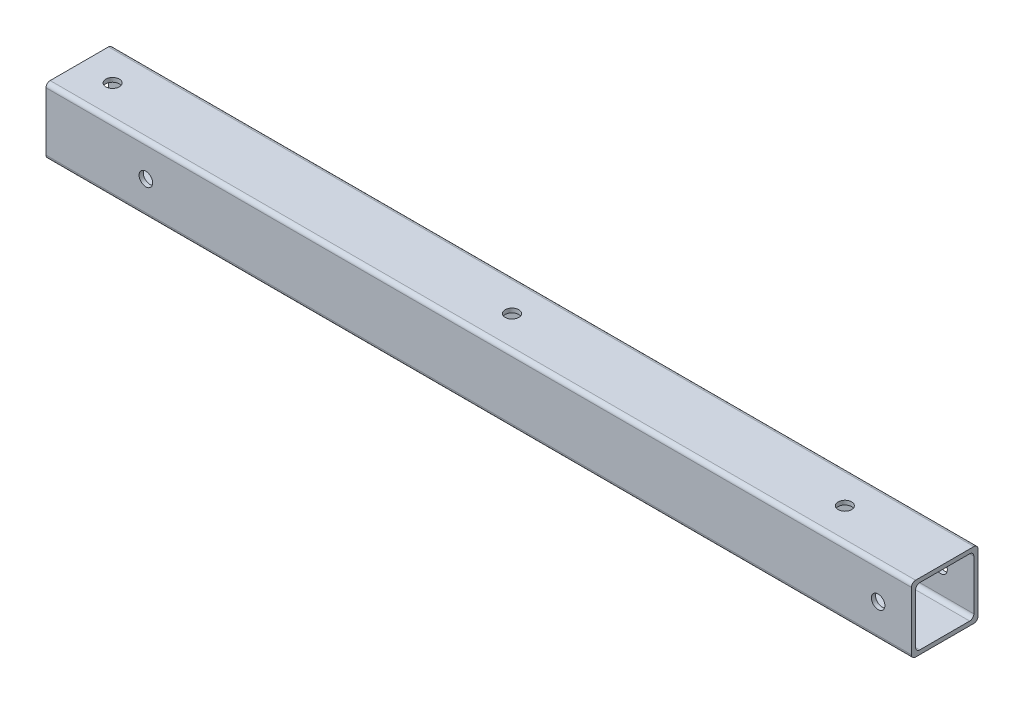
ISO-10303-21;
HEADER;
FILE_DESCRIPTION(('STEP AP214'),'2;1');
FILE_NAME('part.step','',(''),(''),'','','');
FILE_SCHEMA(('AUTOMOTIVE_DESIGN { 1 0 10303 214 1 1 1 1 }'));
ENDSEC;
DATA;
#1=APPLICATION_CONTEXT('core data for automotive mechanical design processes');
#2=APPLICATION_PROTOCOL_DEFINITION('international standard','automotive_design',2000,#1);
#3=PRODUCT_CONTEXT('',#1,'mechanical');
#4=PRODUCT('Part','Part','',(#3));
#5=PRODUCT_RELATED_PRODUCT_CATEGORY('part','',(#4));
#6=PRODUCT_DEFINITION_FORMATION('','',#4);
#7=PRODUCT_DEFINITION_CONTEXT('part definition',#1,'design');
#8=PRODUCT_DEFINITION('design','',#6,#7);
#9=PRODUCT_DEFINITION_SHAPE('','',#8);
#10=(LENGTH_UNIT() NAMED_UNIT(*) SI_UNIT(.MILLI.,.METRE.));
#11=(NAMED_UNIT(*) PLANE_ANGLE_UNIT() SI_UNIT($,.RADIAN.));
#12=(NAMED_UNIT(*) SI_UNIT($,.STERADIAN.) SOLID_ANGLE_UNIT());
#13=UNCERTAINTY_MEASURE_WITH_UNIT(LENGTH_MEASURE(1.E-05),#10,'distance_accuracy_value','');
#14=(GEOMETRIC_REPRESENTATION_CONTEXT(3) GLOBAL_UNCERTAINTY_ASSIGNED_CONTEXT((#13)) GLOBAL_UNIT_ASSIGNED_CONTEXT((#10,
#11,#12)) REPRESENTATION_CONTEXT('',''));
#15=CARTESIAN_POINT('',(0.,0.,0.));
#16=DIRECTION('',(0.,0.,1.));
#17=DIRECTION('',(1.,0.,0.));
#18=AXIS2_PLACEMENT_3D('',#15,#16,#17);
#19=CARTESIAN_POINT('',(0.,101.6,0.));
#20=DIRECTION('',(-1.,0.,0.));
#21=DIRECTION('',(0.,0.,1.));
#22=AXIS2_PLACEMENT_3D('',#19,#20,#21);
#23=PLANE('',#22);
#24=DIRECTION('',(0.,0.,1.));
#25=VECTOR('',#24,1.);
#26=CARTESIAN_POINT('',(0.,95.25,6.35000000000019));
#27=LINE('',#26,#25);
#28=CARTESIAN_POINT('',(0.,95.25,12.7000000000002));
#29=VERTEX_POINT('',#28);
#30=CARTESIAN_POINT('',(0.,95.25,88.9000000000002));
#31=VERTEX_POINT('',#30);
#32=EDGE_CURVE('E169',#29,#31,#27,.T.);
#33=ORIENTED_EDGE('',*,*,#32,.F.);
#34=CARTESIAN_POINT('',(0.,88.9,12.7000000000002));
#35=DIRECTION('',(-1.,0.,0.));
#36=DIRECTION('',(0.,0.,1.));
#37=AXIS2_PLACEMENT_3D('',#34,#35,#36);
#38=CIRCLE('',#37,6.35);
#39=CARTESIAN_POINT('',(0.,88.9,6.35000000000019));
#40=VERTEX_POINT('',#39);
#41=EDGE_CURVE('E179',#29,#40,#38,.T.);
#42=ORIENTED_EDGE('',*,*,#41,.T.);
#43=DIRECTION('',(0.,1.,0.));
#44=VECTOR('',#43,1.);
#45=CARTESIAN_POINT('',(0.,95.25,6.35000000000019));
#46=LINE('',#45,#44);
#47=CARTESIAN_POINT('',(0.,12.7,6.3500000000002));
#48=VERTEX_POINT('',#47);
#49=EDGE_CURVE('E240',#48,#40,#46,.T.);
#50=ORIENTED_EDGE('',*,*,#49,.F.);
#51=CARTESIAN_POINT('',(0.,12.7,12.7000000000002));
#52=DIRECTION('',(-1.,0.,0.));
#53=DIRECTION('',(0.,0.,1.));
#54=AXIS2_PLACEMENT_3D('',#51,#52,#53);
#55=CIRCLE('',#54,6.35);
#56=CARTESIAN_POINT('',(0.,6.35,12.7000000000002));
#57=VERTEX_POINT('',#56);
#58=EDGE_CURVE('E11',#48,#57,#55,.T.);
#59=ORIENTED_EDGE('',*,*,#58,.T.);
#60=DIRECTION('',(0.,0.,-1.));
#61=VECTOR('',#60,1.);
#62=CARTESIAN_POINT('',(0.,6.35,6.35000000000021));
#63=LINE('',#62,#61);
#64=CARTESIAN_POINT('',(0.,6.35,88.9000000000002));
#65=VERTEX_POINT('',#64);
#66=EDGE_CURVE('E253',#65,#57,#63,.T.);
#67=ORIENTED_EDGE('',*,*,#66,.F.);
#68=CARTESIAN_POINT('',(0.,12.7,88.9000000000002));
#69=DIRECTION('',(-1.,0.,0.));
#70=DIRECTION('',(0.,0.,1.));
#71=AXIS2_PLACEMENT_3D('',#68,#69,#70);
#72=CIRCLE('',#71,6.35);
#73=CARTESIAN_POINT('',(0.,12.7,95.2500000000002));
#74=VERTEX_POINT('',#73);
#75=EDGE_CURVE('E168',#65,#74,#72,.T.);
#76=ORIENTED_EDGE('',*,*,#75,.T.);
#77=DIRECTION('',(0.,-1.,0.));
#78=VECTOR('',#77,1.);
#79=CARTESIAN_POINT('',(0.,95.25,95.2500000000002));
#80=LINE('',#79,#78);
#81=CARTESIAN_POINT('',(0.,88.9,95.2500000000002));
#82=VERTEX_POINT('',#81);
#83=EDGE_CURVE('E152',#82,#74,#80,.T.);
#84=ORIENTED_EDGE('',*,*,#83,.F.);
#85=CARTESIAN_POINT('',(0.,88.9,88.9000000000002));
#86=DIRECTION('',(-1.,0.,0.));
#87=DIRECTION('',(0.,0.,1.));
#88=AXIS2_PLACEMENT_3D('',#85,#86,#87);
#89=CIRCLE('',#88,6.35);
#90=EDGE_CURVE('E164',#82,#31,#89,.T.);
#91=ORIENTED_EDGE('',*,*,#90,.T.);
#92=EDGE_LOOP('',(#33,#42,#50,#59,#67,#76,#84,#91));
#93=FACE_BOUND('',#92,.T.);
#94=DIRECTION('',(0.,-1.,0.));
#95=VECTOR('',#94,1.);
#96=CARTESIAN_POINT('',(0.,101.6,101.6));
#97=LINE('',#96,#95);
#98=CARTESIAN_POINT('',(0.,95.25,101.6));
#99=VERTEX_POINT('',#98);
#100=CARTESIAN_POINT('',(0.,6.34999999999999,101.6));
#101=VERTEX_POINT('',#100);
#102=EDGE_CURVE('E264',#99,#101,#97,.T.);
#103=ORIENTED_EDGE('',*,*,#102,.T.);
#104=CARTESIAN_POINT('',(0.,6.34999999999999,95.25));
#105=DIRECTION('',(-1.,0.,0.));
#106=DIRECTION('',(0.,0.,1.));
#107=AXIS2_PLACEMENT_3D('',#104,#105,#106);
#108=CIRCLE('',#107,6.35);
#109=CARTESIAN_POINT('',(0.,0.,95.25));
#110=VERTEX_POINT('',#109);
#111=EDGE_CURVE('E295',#101,#110,#108,.F.);
#112=ORIENTED_EDGE('',*,*,#111,.T.);
#113=DIRECTION('',(0.,0.,-1.));
#114=VECTOR('',#113,1.);
#115=CARTESIAN_POINT('',(0.,0.,0.));
#116=LINE('',#115,#114);
#117=CARTESIAN_POINT('',(0.,0.,6.35));
#118=VERTEX_POINT('',#117);
#119=EDGE_CURVE('E256',#110,#118,#116,.T.);
#120=ORIENTED_EDGE('',*,*,#119,.T.);
#121=CARTESIAN_POINT('',(0.,6.34999999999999,6.35));
#122=DIRECTION('',(-1.,0.,0.));
#123=DIRECTION('',(0.,0.,1.));
#124=AXIS2_PLACEMENT_3D('',#121,#122,#123);
#125=CIRCLE('',#124,6.35);
#126=CARTESIAN_POINT('',(0.,6.34999999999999,0.));
#127=VERTEX_POINT('',#126);
#128=EDGE_CURVE('E289',#118,#127,#125,.F.);
#129=ORIENTED_EDGE('',*,*,#128,.T.);
#130=DIRECTION('',(0.,-1.,0.));
#131=VECTOR('',#130,1.);
#132=CARTESIAN_POINT('',(0.,101.6,0.));
#133=LINE('',#132,#131);
#134=CARTESIAN_POINT('',(0.,95.25,0.));
#135=VERTEX_POINT('',#134);
#136=EDGE_CURVE('E159',#135,#127,#133,.T.);
#137=ORIENTED_EDGE('',*,*,#136,.F.);
#138=CARTESIAN_POINT('',(0.,95.25,6.35));
#139=DIRECTION('',(-1.,0.,0.));
#140=DIRECTION('',(0.,0.,1.));
#141=AXIS2_PLACEMENT_3D('',#138,#139,#140);
#142=CIRCLE('',#141,6.35);
#143=CARTESIAN_POINT('',(0.,101.6,6.35));
#144=VERTEX_POINT('',#143);
#145=EDGE_CURVE('E291',#135,#144,#142,.F.);
#146=ORIENTED_EDGE('',*,*,#145,.T.);
#147=DIRECTION('',(0.,0.,-1.));
#148=VECTOR('',#147,1.);
#149=CARTESIAN_POINT('',(0.,101.6,0.));
#150=LINE('',#149,#148);
#151=CARTESIAN_POINT('',(0.,101.6,95.25));
#152=VERTEX_POINT('',#151);
#153=EDGE_CURVE('E257',#152,#144,#150,.T.);
#154=ORIENTED_EDGE('',*,*,#153,.F.);
#155=CARTESIAN_POINT('',(0.,95.25,95.25));
#156=DIRECTION('',(-1.,0.,0.));
#157=DIRECTION('',(0.,0.,1.));
#158=AXIS2_PLACEMENT_3D('',#155,#156,#157);
#159=CIRCLE('',#158,6.35);
#160=EDGE_CURVE('E293',#152,#99,#159,.F.);
#161=ORIENTED_EDGE('',*,*,#160,.T.);
#162=EDGE_LOOP('',(#103,#112,#120,#129,#137,#146,#154,#161));
#163=FACE_BOUND('',#162,.T.);
#164=ADVANCED_FACE('F31',(#93,#163),#23,.F.);
#165=CARTESIAN_POINT('',(0.,101.6,0.));
#166=DIRECTION('',(0.,0.,1.));
#167=DIRECTION('',(1.,0.,0.));
#168=AXIS2_PLACEMENT_3D('',#165,#166,#167);
#169=PLANE('',#168);
#170=CARTESIAN_POINT('',(-50.8,50.8,0.));
#171=DIRECTION('',(0.,0.,1.));
#172=DIRECTION('',(1.,0.,0.));
#173=AXIS2_PLACEMENT_3D('',#170,#171,#172);
#174=CIRCLE('',#173,10.31875);
#175=CARTESIAN_POINT('',(-40.48125,50.8,0.));
#176=VERTEX_POINT('',#175);
#177=EDGE_CURVE('E198',#176,#176,#174,.T.);
#178=ORIENTED_EDGE('',*,*,#177,.T.);
#179=EDGE_LOOP('',(#178));
#180=FACE_BOUND('',#179,.T.);
#181=CARTESIAN_POINT('',(-1168.4,50.8,0.));
#182=DIRECTION('',(0.,0.,1.));
#183=DIRECTION('',(1.,0.,0.));
#184=AXIS2_PLACEMENT_3D('',#181,#182,#183);
#185=CIRCLE('',#184,10.31875);
#186=CARTESIAN_POINT('',(-1158.08125,50.8,0.));
#187=VERTEX_POINT('',#186);
#188=EDGE_CURVE('E194',#187,#187,#185,.T.);
#189=ORIENTED_EDGE('',*,*,#188,.T.);
#190=EDGE_LOOP('',(#189));
#191=FACE_BOUND('',#190,.T.);
#192=DIRECTION('',(0.,-1.,0.));
#193=VECTOR('',#192,1.);
#194=CARTESIAN_POINT('',(-1320.8,101.6,1.6174600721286E-13));
#195=LINE('',#194,#193);
#196=CARTESIAN_POINT('',(-1320.8,95.25,1.6174600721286E-13));
#197=VERTEX_POINT('',#196);
#198=CARTESIAN_POINT('',(-1320.8,6.34999999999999,1.6174600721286E-13));
#199=VERTEX_POINT('',#198);
#200=EDGE_CURVE('E274',#197,#199,#195,.T.);
#201=ORIENTED_EDGE('',*,*,#200,.F.);
#202=DIRECTION('',(-1.,0.,0.));
#203=VECTOR('',#202,1.);
#204=CARTESIAN_POINT('',(0.,95.25,0.));
#205=LINE('',#204,#203);
#206=EDGE_CURVE('E323',#197,#135,#205,.F.);
#207=ORIENTED_EDGE('',*,*,#206,.T.);
#208=ORIENTED_EDGE('',*,*,#136,.T.);
#209=DIRECTION('',(-1.,0.,0.));
#210=VECTOR('',#209,1.);
#211=CARTESIAN_POINT('',(-1320.8,6.34999999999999,1.6174600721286E-13));
#212=LINE('',#211,#210);
#213=EDGE_CURVE('E321',#127,#199,#212,.T.);
#214=ORIENTED_EDGE('',*,*,#213,.T.);
#215=EDGE_LOOP('',(#201,#207,#208,#214));
#216=FACE_BOUND('',#215,.T.);
#217=ADVANCED_FACE('F349',(#180,#191,#216),#169,.F.);
#218=CARTESIAN_POINT('',(-1320.8,101.6,1.6174600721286E-13));
#219=DIRECTION('',(1.,0.,0.));
#220=DIRECTION('',(0.,0.,-1.));
#221=AXIS2_PLACEMENT_3D('',#218,#219,#220);
#222=PLANE('',#221);
#223=DIRECTION('',(0.,0.,1.));
#224=VECTOR('',#223,1.);
#225=CARTESIAN_POINT('',(-1320.8,6.35,6.35000000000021));
#226=LINE('',#225,#224);
#227=CARTESIAN_POINT('',(-1320.8,6.35,12.7000000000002));
#228=VERTEX_POINT('',#227);
#229=CARTESIAN_POINT('',(-1320.8,6.35,88.9000000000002));
#230=VERTEX_POINT('',#229);
#231=EDGE_CURVE('E246',#228,#230,#226,.T.);
#232=ORIENTED_EDGE('',*,*,#231,.F.);
#233=CARTESIAN_POINT('',(-1320.8,12.7,12.7000000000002));
#234=DIRECTION('',(1.,0.,0.));
#235=DIRECTION('',(0.,0.,-1.));
#236=AXIS2_PLACEMENT_3D('',#233,#234,#235);
#237=CIRCLE('',#236,6.35);
#238=CARTESIAN_POINT('',(-1320.8,12.7,6.3500000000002));
#239=VERTEX_POINT('',#238);
#240=EDGE_CURVE('E40',#228,#239,#237,.T.);
#241=ORIENTED_EDGE('',*,*,#240,.T.);
#242=DIRECTION('',(0.,-1.,0.));
#243=VECTOR('',#242,1.);
#244=CARTESIAN_POINT('',(-1320.8,95.25,6.35000000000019));
#245=LINE('',#244,#243);
#246=CARTESIAN_POINT('',(-1320.8,88.9,6.35000000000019));
#247=VERTEX_POINT('',#246);
#248=EDGE_CURVE('E243',#247,#239,#245,.T.);
#249=ORIENTED_EDGE('',*,*,#248,.F.);
#250=CARTESIAN_POINT('',(-1320.8,88.9,12.7000000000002));
#251=DIRECTION('',(1.,0.,0.));
#252=DIRECTION('',(0.,0.,-1.));
#253=AXIS2_PLACEMENT_3D('',#250,#251,#252);
#254=CIRCLE('',#253,6.35);
#255=CARTESIAN_POINT('',(-1320.8,95.25,12.7000000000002));
#256=VERTEX_POINT('',#255);
#257=EDGE_CURVE('E176',#247,#256,#254,.T.);
#258=ORIENTED_EDGE('',*,*,#257,.T.);
#259=DIRECTION('',(0.,0.,-1.));
#260=VECTOR('',#259,1.);
#261=CARTESIAN_POINT('',(-1320.8,95.25,6.35000000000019));
#262=LINE('',#261,#260);
#263=CARTESIAN_POINT('',(-1320.8,95.25,88.9000000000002));
#264=VERTEX_POINT('',#263);
#265=EDGE_CURVE('E250',#264,#256,#262,.T.);
#266=ORIENTED_EDGE('',*,*,#265,.F.);
#267=CARTESIAN_POINT('',(-1320.8,88.9,88.9000000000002));
#268=DIRECTION('',(1.,0.,0.));
#269=DIRECTION('',(0.,0.,-1.));
#270=AXIS2_PLACEMENT_3D('',#267,#268,#269);
#271=CIRCLE('',#270,6.35);
#272=CARTESIAN_POINT('',(-1320.8,88.9,95.2500000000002));
#273=VERTEX_POINT('',#272);
#274=EDGE_CURVE('E177',#264,#273,#271,.T.);
#275=ORIENTED_EDGE('',*,*,#274,.T.);
#276=DIRECTION('',(0.,1.,0.));
#277=VECTOR('',#276,1.);
#278=CARTESIAN_POINT('',(-1320.8,95.25,95.2500000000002));
#279=LINE('',#278,#277);
#280=CARTESIAN_POINT('',(-1320.8,12.7,95.2500000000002));
#281=VERTEX_POINT('',#280);
#282=EDGE_CURVE('E155',#281,#273,#279,.T.);
#283=ORIENTED_EDGE('',*,*,#282,.F.);
#284=CARTESIAN_POINT('',(-1320.8,12.7,88.9000000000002));
#285=DIRECTION('',(1.,0.,0.));
#286=DIRECTION('',(0.,0.,-1.));
#287=AXIS2_PLACEMENT_3D('',#284,#285,#286);
#288=CIRCLE('',#287,6.35);
#289=EDGE_CURVE('E325',#281,#230,#288,.T.);
#290=ORIENTED_EDGE('',*,*,#289,.T.);
#291=EDGE_LOOP('',(#232,#241,#249,#258,#266,#275,#283,#290));
#292=FACE_BOUND('',#291,.T.);
#293=DIRECTION('',(0.,0.,1.));
#294=VECTOR('',#293,1.);
#295=CARTESIAN_POINT('',(-1320.8,0.,1.6174600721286E-13));
#296=LINE('',#295,#294);
#297=CARTESIAN_POINT('',(-1320.8,0.,6.35000000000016));
#298=VERTEX_POINT('',#297);
#299=CARTESIAN_POINT('',(-1320.8,0.,95.2500000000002));
#300=VERTEX_POINT('',#299);
#301=EDGE_CURVE('E261',#298,#300,#296,.T.);
#302=ORIENTED_EDGE('',*,*,#301,.T.);
#303=CARTESIAN_POINT('',(-1320.8,6.34999999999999,95.2500000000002));
#304=DIRECTION('',(1.,0.,0.));
#305=DIRECTION('',(0.,0.,-1.));
#306=AXIS2_PLACEMENT_3D('',#303,#304,#305);
#307=CIRCLE('',#306,6.35);
#308=CARTESIAN_POINT('',(-1320.8,6.34999999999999,101.6));
#309=VERTEX_POINT('',#308);
#310=EDGE_CURVE('E305',#300,#309,#307,.F.);
#311=ORIENTED_EDGE('',*,*,#310,.T.);
#312=DIRECTION('',(0.,-1.,0.));
#313=VECTOR('',#312,1.);
#314=CARTESIAN_POINT('',(-1320.8,101.6,101.6));
#315=LINE('',#314,#313);
#316=CARTESIAN_POINT('',(-1320.8,95.25,101.6));
#317=VERTEX_POINT('',#316);
#318=EDGE_CURVE('E271',#317,#309,#315,.T.);
#319=ORIENTED_EDGE('',*,*,#318,.F.);
#320=CARTESIAN_POINT('',(-1320.8,95.25,95.2500000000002));
#321=DIRECTION('',(1.,0.,0.));
#322=DIRECTION('',(0.,0.,-1.));
#323=AXIS2_PLACEMENT_3D('',#320,#321,#322);
#324=CIRCLE('',#323,6.35);
#325=CARTESIAN_POINT('',(-1320.8,101.6,95.2500000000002));
#326=VERTEX_POINT('',#325);
#327=EDGE_CURVE('E303',#317,#326,#324,.F.);
#328=ORIENTED_EDGE('',*,*,#327,.T.);
#329=DIRECTION('',(0.,0.,1.));
#330=VECTOR('',#329,1.);
#331=CARTESIAN_POINT('',(-1320.8,101.6,1.6174600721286E-13));
#332=LINE('',#331,#330);
#333=CARTESIAN_POINT('',(-1320.8,101.6,6.35000000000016));
#334=VERTEX_POINT('',#333);
#335=EDGE_CURVE('E260',#334,#326,#332,.T.);
#336=ORIENTED_EDGE('',*,*,#335,.F.);
#337=CARTESIAN_POINT('',(-1320.8,95.25,6.35000000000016));
#338=DIRECTION('',(1.,0.,0.));
#339=DIRECTION('',(0.,0.,-1.));
#340=AXIS2_PLACEMENT_3D('',#337,#338,#339);
#341=CIRCLE('',#340,6.35);
#342=EDGE_CURVE('E56',#334,#197,#341,.F.);
#343=ORIENTED_EDGE('',*,*,#342,.T.);
#344=ORIENTED_EDGE('',*,*,#200,.T.);
#345=CARTESIAN_POINT('',(-1320.8,6.34999999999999,6.35000000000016));
#346=DIRECTION('',(1.,0.,0.));
#347=DIRECTION('',(0.,0.,-1.));
#348=AXIS2_PLACEMENT_3D('',#345,#346,#347);
#349=CIRCLE('',#348,6.35);
#350=EDGE_CURVE('E48',#199,#298,#349,.F.);
#351=ORIENTED_EDGE('',*,*,#350,.T.);
#352=EDGE_LOOP('',(#302,#311,#319,#328,#336,#343,#344,#351));
#353=FACE_BOUND('',#352,.T.);
#354=ADVANCED_FACE('F328',(#292,#353),#222,.F.);
#355=CARTESIAN_POINT('',(0.,101.6,101.6));
#356=DIRECTION('',(0.,0.,-1.));
#357=DIRECTION('',(-1.,0.,0.));
#358=AXIS2_PLACEMENT_3D('',#355,#356,#357);
#359=PLANE('',#358);
#360=CARTESIAN_POINT('',(-50.8,50.8,101.6));
#361=DIRECTION('',(0.,0.,1.));
#362=DIRECTION('',(1.,0.,0.));
#363=AXIS2_PLACEMENT_3D('',#360,#361,#362);
#364=CIRCLE('',#363,10.31875);
#365=CARTESIAN_POINT('',(-40.48125,50.8,101.6));
#366=VERTEX_POINT('',#365);
#367=EDGE_CURVE('E206',#366,#366,#364,.T.);
#368=ORIENTED_EDGE('',*,*,#367,.F.);
#369=EDGE_LOOP('',(#368));
#370=FACE_BOUND('',#369,.T.);
#371=CARTESIAN_POINT('',(-1168.4,50.8,101.6));
#372=DIRECTION('',(0.,0.,1.));
#373=DIRECTION('',(1.,0.,0.));
#374=AXIS2_PLACEMENT_3D('',#371,#372,#373);
#375=CIRCLE('',#374,10.31875);
#376=CARTESIAN_POINT('',(-1158.08125,50.8,101.6));
#377=VERTEX_POINT('',#376);
#378=EDGE_CURVE('E225',#377,#377,#375,.T.);
#379=ORIENTED_EDGE('',*,*,#378,.F.);
#380=EDGE_LOOP('',(#379));
#381=FACE_BOUND('',#380,.T.);
#382=ORIENTED_EDGE('',*,*,#318,.T.);
#383=DIRECTION('',(1.,0.,0.));
#384=VECTOR('',#383,1.);
#385=CARTESIAN_POINT('',(0.,6.34999999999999,101.6));
#386=LINE('',#385,#384);
#387=EDGE_CURVE('E286',#309,#101,#386,.T.);
#388=ORIENTED_EDGE('',*,*,#387,.T.);
#389=ORIENTED_EDGE('',*,*,#102,.F.);
#390=DIRECTION('',(1.,0.,0.));
#391=VECTOR('',#390,1.);
#392=CARTESIAN_POINT('',(0.,95.25,101.6));
#393=LINE('',#392,#391);
#394=EDGE_CURVE('E284',#99,#317,#393,.F.);
#395=ORIENTED_EDGE('',*,*,#394,.T.);
#396=EDGE_LOOP('',(#382,#388,#389,#395));
#397=FACE_BOUND('',#396,.T.);
#398=ADVANCED_FACE('F358',(#370,#381,#397),#359,.F.);
#399=CARTESIAN_POINT('',(0.,101.6,0.));
#400=DIRECTION('',(0.,-1.,0.));
#401=DIRECTION('',(0.,0.,-1.));
#402=AXIS2_PLACEMENT_3D('',#399,#400,#401);
#403=PLANE('',#402);
#404=CARTESIAN_POINT('',(-660.4,101.6,50.8));
#405=DIRECTION('',(0.,-1.,0.));
#406=DIRECTION('',(0.,0.,-1.));
#407=AXIS2_PLACEMENT_3D('',#404,#405,#406);
#408=CIRCLE('',#407,10.31875);
#409=CARTESIAN_POINT('',(-660.4,101.6,40.48125));
#410=VERTEX_POINT('',#409);
#411=EDGE_CURVE('E412',#410,#410,#408,.T.);
#412=ORIENTED_EDGE('',*,*,#411,.T.);
#413=EDGE_LOOP('',(#412));
#414=FACE_BOUND('',#413,.T.);
#415=CARTESIAN_POINT('',(-152.4,101.6,50.8));
#416=DIRECTION('',(0.,1.,0.));
#417=DIRECTION('',(0.,0.,1.));
#418=AXIS2_PLACEMENT_3D('',#415,#416,#417);
#419=CIRCLE('',#418,10.31875);
#420=CARTESIAN_POINT('',(-152.4,101.6,61.11875));
#421=VERTEX_POINT('',#420);
#422=EDGE_CURVE('E209',#421,#421,#419,.T.);
#423=ORIENTED_EDGE('',*,*,#422,.F.);
#424=EDGE_LOOP('',(#423));
#425=FACE_BOUND('',#424,.T.);
#426=CARTESIAN_POINT('',(-1270.,101.6,50.8));
#427=DIRECTION('',(0.,1.,0.));
#428=DIRECTION('',(0.,0.,1.));
#429=AXIS2_PLACEMENT_3D('',#426,#427,#428);
#430=CIRCLE('',#429,10.31875);
#431=CARTESIAN_POINT('',(-1270.,101.6,61.11875));
#432=VERTEX_POINT('',#431);
#433=EDGE_CURVE('E232',#432,#432,#430,.T.);
#434=ORIENTED_EDGE('',*,*,#433,.F.);
#435=EDGE_LOOP('',(#434));
#436=FACE_BOUND('',#435,.T.);
#437=ORIENTED_EDGE('',*,*,#335,.T.);
#438=DIRECTION('',(1.,0.,0.));
#439=VECTOR('',#438,1.);
#440=CARTESIAN_POINT('',(0.,101.6,95.25));
#441=LINE('',#440,#439);
#442=EDGE_CURVE('E310',#326,#152,#441,.T.);
#443=ORIENTED_EDGE('',*,*,#442,.T.);
#444=ORIENTED_EDGE('',*,*,#153,.T.);
#445=DIRECTION('',(-1.,0.,0.));
#446=VECTOR('',#445,1.);
#447=CARTESIAN_POINT('',(0.,101.6,6.35));
#448=LINE('',#447,#446);
#449=EDGE_CURVE('E307',#144,#334,#448,.T.);
#450=ORIENTED_EDGE('',*,*,#449,.T.);
#451=EDGE_LOOP('',(#437,#443,#444,#450));
#452=FACE_BOUND('',#451,.T.);
#453=ADVANCED_FACE('F361',(#414,#425,#436,#452),#403,.F.);
#454=CARTESIAN_POINT('',(0.,0.,0.));
#455=DIRECTION('',(0.,-1.,0.));
#456=DIRECTION('',(0.,0.,-1.));
#457=AXIS2_PLACEMENT_3D('',#454,#455,#456);
#458=PLANE('',#457);
#459=CARTESIAN_POINT('',(-660.4,0.,50.8));
#460=DIRECTION('',(0.,-1.,0.));
#461=DIRECTION('',(0.,0.,-1.));
#462=AXIS2_PLACEMENT_3D('',#459,#460,#461);
#463=CIRCLE('',#462,10.31875);
#464=CARTESIAN_POINT('',(-660.4,0.,40.48125));
#465=VERTEX_POINT('',#464);
#466=EDGE_CURVE('E417',#465,#465,#463,.T.);
#467=ORIENTED_EDGE('',*,*,#466,.F.);
#468=EDGE_LOOP('',(#467));
#469=FACE_BOUND('',#468,.T.);
#470=CARTESIAN_POINT('',(-152.4,0.,50.8));
#471=DIRECTION('',(0.,1.,0.));
#472=DIRECTION('',(0.,0.,1.));
#473=AXIS2_PLACEMENT_3D('',#470,#471,#472);
#474=CIRCLE('',#473,10.31875);
#475=CARTESIAN_POINT('',(-152.4,0.,61.11875));
#476=VERTEX_POINT('',#475);
#477=EDGE_CURVE('E202',#476,#476,#474,.T.);
#478=ORIENTED_EDGE('',*,*,#477,.T.);
#479=EDGE_LOOP('',(#478));
#480=FACE_BOUND('',#479,.T.);
#481=CARTESIAN_POINT('',(-1270.,0.,50.8));
#482=DIRECTION('',(0.,1.,0.));
#483=DIRECTION('',(0.,0.,1.));
#484=AXIS2_PLACEMENT_3D('',#481,#482,#483);
#485=CIRCLE('',#484,10.31875);
#486=CARTESIAN_POINT('',(-1270.,0.,61.11875));
#487=VERTEX_POINT('',#486);
#488=EDGE_CURVE('E189',#487,#487,#485,.T.);
#489=ORIENTED_EDGE('',*,*,#488,.T.);
#490=EDGE_LOOP('',(#489));
#491=FACE_BOUND('',#490,.T.);
#492=ORIENTED_EDGE('',*,*,#119,.F.);
#493=DIRECTION('',(1.,0.,0.));
#494=VECTOR('',#493,1.);
#495=CARTESIAN_POINT('',(-1320.8,0.,95.2500000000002));
#496=LINE('',#495,#494);
#497=EDGE_CURVE('E299',#110,#300,#496,.F.);
#498=ORIENTED_EDGE('',*,*,#497,.T.);
#499=ORIENTED_EDGE('',*,*,#301,.F.);
#500=DIRECTION('',(-1.,0.,0.));
#501=VECTOR('',#500,1.);
#502=CARTESIAN_POINT('',(0.,0.,6.35));
#503=LINE('',#502,#501);
#504=EDGE_CURVE('E297',#298,#118,#503,.F.);
#505=ORIENTED_EDGE('',*,*,#504,.T.);
#506=EDGE_LOOP('',(#492,#498,#499,#505));
#507=FACE_BOUND('',#506,.T.);
#508=ADVANCED_FACE('F363',(#469,#480,#491,#507),#458,.T.);
#509=CARTESIAN_POINT('',(0.000999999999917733,95.25,6.35000000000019));
#510=DIRECTION('',(0.,0.,-1.));
#511=DIRECTION('',(0.,1.,0.));
#512=AXIS2_PLACEMENT_3D('',#509,#510,#511);
#513=PLANE('',#512);
#514=CARTESIAN_POINT('',(-50.8,50.8,6.3500000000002));
#515=DIRECTION('',(0.,0.,-1.));
#516=DIRECTION('',(0.,1.,0.));
#517=AXIS2_PLACEMENT_3D('',#514,#515,#516);
#518=CIRCLE('',#517,10.31875);
#519=CARTESIAN_POINT('',(-50.8,61.11875,6.3500000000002));
#520=VERTEX_POINT('',#519);
#521=EDGE_CURVE('E197',#520,#520,#518,.T.);
#522=ORIENTED_EDGE('',*,*,#521,.T.);
#523=EDGE_LOOP('',(#522));
#524=FACE_BOUND('',#523,.T.);
#525=CARTESIAN_POINT('',(-1168.4,50.8,6.3500000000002));
#526=DIRECTION('',(0.,0.,-1.));
#527=DIRECTION('',(0.,1.,0.));
#528=AXIS2_PLACEMENT_3D('',#525,#526,#527);
#529=CIRCLE('',#528,10.31875);
#530=CARTESIAN_POINT('',(-1168.4,61.11875,6.3500000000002));
#531=VERTEX_POINT('',#530);
#532=EDGE_CURVE('E193',#531,#531,#529,.T.);
#533=ORIENTED_EDGE('',*,*,#532,.T.);
#534=EDGE_LOOP('',(#533));
#535=FACE_BOUND('',#534,.T.);
#536=ORIENTED_EDGE('',*,*,#49,.T.);
#537=DIRECTION('',(-1.,0.,0.));
#538=VECTOR('',#537,1.);
#539=CARTESIAN_POINT('',(-1320.8,88.9,6.35000000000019));
#540=LINE('',#539,#538);
#541=EDGE_CURVE('E318',#40,#247,#540,.T.);
#542=ORIENTED_EDGE('',*,*,#541,.T.);
#543=ORIENTED_EDGE('',*,*,#248,.T.);
#544=DIRECTION('',(-1.,0.,0.));
#545=VECTOR('',#544,1.);
#546=CARTESIAN_POINT('',(0.,12.7,6.3500000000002));
#547=LINE('',#546,#545);
#548=EDGE_CURVE('E316',#239,#48,#547,.F.);
#549=ORIENTED_EDGE('',*,*,#548,.T.);
#550=EDGE_LOOP('',(#536,#542,#543,#549));
#551=FACE_BOUND('',#550,.T.);
#552=ADVANCED_FACE('F366',(#524,#535,#551),#513,.F.);
#553=CARTESIAN_POINT('',(0.000999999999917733,95.25,6.35000000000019));
#554=DIRECTION('',(0.,1.,0.));
#555=DIRECTION('',(0.,0.,1.));
#556=AXIS2_PLACEMENT_3D('',#553,#554,#555);
#557=PLANE('',#556);
#558=CARTESIAN_POINT('',(-660.4,95.25,50.8));
#559=DIRECTION('',(0.,1.,0.));
#560=DIRECTION('',(0.,0.,1.));
#561=AXIS2_PLACEMENT_3D('',#558,#559,#560);
#562=CIRCLE('',#561,10.31875);
#563=CARTESIAN_POINT('',(-660.4,95.25,61.11875));
#564=VERTEX_POINT('',#563);
#565=EDGE_CURVE('E214',#564,#564,#562,.T.);
#566=ORIENTED_EDGE('',*,*,#565,.T.);
#567=EDGE_LOOP('',(#566));
#568=FACE_BOUND('',#567,.T.);
#569=CARTESIAN_POINT('',(-152.4,95.25,50.8));
#570=DIRECTION('',(0.,1.,0.));
#571=DIRECTION('',(0.,0.,1.));
#572=AXIS2_PLACEMENT_3D('',#569,#570,#571);
#573=CIRCLE('',#572,10.31875);
#574=CARTESIAN_POINT('',(-152.4,95.25,61.11875));
#575=VERTEX_POINT('',#574);
#576=EDGE_CURVE('E201',#575,#575,#573,.T.);
#577=ORIENTED_EDGE('',*,*,#576,.T.);
#578=EDGE_LOOP('',(#577));
#579=FACE_BOUND('',#578,.T.);
#580=CARTESIAN_POINT('',(-1270.,95.25,50.8));
#581=DIRECTION('',(0.,1.,0.));
#582=DIRECTION('',(0.,0.,1.));
#583=AXIS2_PLACEMENT_3D('',#580,#581,#582);
#584=CIRCLE('',#583,10.31875);
#585=CARTESIAN_POINT('',(-1270.,95.25,61.11875));
#586=VERTEX_POINT('',#585);
#587=EDGE_CURVE('E170',#586,#586,#584,.T.);
#588=ORIENTED_EDGE('',*,*,#587,.T.);
#589=EDGE_LOOP('',(#588));
#590=FACE_BOUND('',#589,.T.);
#591=ORIENTED_EDGE('',*,*,#32,.T.);
#592=DIRECTION('',(-1.,0.,0.));
#593=VECTOR('',#592,1.);
#594=CARTESIAN_POINT('',(-1320.8,95.25,88.9000000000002));
#595=LINE('',#594,#593);
#596=EDGE_CURVE('E175',#31,#264,#595,.T.);
#597=ORIENTED_EDGE('',*,*,#596,.T.);
#598=ORIENTED_EDGE('',*,*,#265,.T.);
#599=DIRECTION('',(-1.,0.,0.));
#600=VECTOR('',#599,1.);
#601=CARTESIAN_POINT('',(0.,95.25,12.7000000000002));
#602=LINE('',#601,#600);
#603=EDGE_CURVE('E313',#256,#29,#602,.F.);
#604=ORIENTED_EDGE('',*,*,#603,.T.);
#605=EDGE_LOOP('',(#591,#597,#598,#604));
#606=FACE_BOUND('',#605,.T.);
#607=ADVANCED_FACE('F372',(#568,#579,#590,#606),#557,.F.);
#608=CARTESIAN_POINT('',(0.000999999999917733,95.25,95.2500000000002));
#609=DIRECTION('',(0.,0.,1.));
#610=DIRECTION('',(0.,-1.,0.));
#611=AXIS2_PLACEMENT_3D('',#608,#609,#610);
#612=PLANE('',#611);
#613=CARTESIAN_POINT('',(-50.8,50.8,95.2500000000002));
#614=DIRECTION('',(0.,0.,1.));
#615=DIRECTION('',(0.,-1.,0.));
#616=AXIS2_PLACEMENT_3D('',#613,#614,#615);
#617=CIRCLE('',#616,10.31875);
#618=CARTESIAN_POINT('',(-50.8,40.48125,95.2500000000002));
#619=VERTEX_POINT('',#618);
#620=EDGE_CURVE('E195',#619,#619,#617,.T.);
#621=ORIENTED_EDGE('',*,*,#620,.T.);
#622=EDGE_LOOP('',(#621));
#623=FACE_BOUND('',#622,.T.);
#624=CARTESIAN_POINT('',(-1168.4,50.8,95.2500000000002));
#625=DIRECTION('',(0.,0.,1.));
#626=DIRECTION('',(0.,-1.,0.));
#627=AXIS2_PLACEMENT_3D('',#624,#625,#626);
#628=CIRCLE('',#627,10.31875);
#629=CARTESIAN_POINT('',(-1168.4,40.48125,95.2500000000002));
#630=VERTEX_POINT('',#629);
#631=EDGE_CURVE('E190',#630,#630,#628,.T.);
#632=ORIENTED_EDGE('',*,*,#631,.T.);
#633=EDGE_LOOP('',(#632));
#634=FACE_BOUND('',#633,.T.);
#635=ORIENTED_EDGE('',*,*,#83,.T.);
#636=DIRECTION('',(-1.,0.,0.));
#637=VECTOR('',#636,1.);
#638=CARTESIAN_POINT('',(-1320.8,12.7,95.2500000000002));
#639=LINE('',#638,#637);
#640=EDGE_CURVE('E158',#74,#281,#639,.T.);
#641=ORIENTED_EDGE('',*,*,#640,.T.);
#642=ORIENTED_EDGE('',*,*,#282,.T.);
#643=DIRECTION('',(-1.,0.,0.));
#644=VECTOR('',#643,1.);
#645=CARTESIAN_POINT('',(0.,88.9,95.2500000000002));
#646=LINE('',#645,#644);
#647=EDGE_CURVE('E148',#273,#82,#646,.F.);
#648=ORIENTED_EDGE('',*,*,#647,.T.);
#649=EDGE_LOOP('',(#635,#641,#642,#648));
#650=FACE_BOUND('',#649,.T.);
#651=ADVANCED_FACE('F150',(#623,#634,#650),#612,.F.);
#652=CARTESIAN_POINT('',(0.000999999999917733,6.35,6.35000000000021));
#653=DIRECTION('',(0.,-1.,0.));
#654=DIRECTION('',(0.,0.,-1.));
#655=AXIS2_PLACEMENT_3D('',#652,#653,#654);
#656=PLANE('',#655);
#657=CARTESIAN_POINT('',(-660.4,6.34999999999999,50.8));
#658=DIRECTION('',(0.,-1.,0.));
#659=DIRECTION('',(0.,0.,-1.));
#660=AXIS2_PLACEMENT_3D('',#657,#658,#659);
#661=CIRCLE('',#660,10.31875);
#662=CARTESIAN_POINT('',(-660.4,6.34999999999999,40.48125));
#663=VERTEX_POINT('',#662);
#664=EDGE_CURVE('E35',#663,#663,#661,.T.);
#665=ORIENTED_EDGE('',*,*,#664,.T.);
#666=EDGE_LOOP('',(#665));
#667=FACE_BOUND('',#666,.T.);
#668=CARTESIAN_POINT('',(-152.4,6.35,50.8));
#669=DIRECTION('',(0.,-1.,0.));
#670=DIRECTION('',(0.,0.,-1.));
#671=AXIS2_PLACEMENT_3D('',#668,#669,#670);
#672=CIRCLE('',#671,10.31875);
#673=CARTESIAN_POINT('',(-152.4,6.35,40.48125));
#674=VERTEX_POINT('',#673);
#675=EDGE_CURVE('E199',#674,#674,#672,.T.);
#676=ORIENTED_EDGE('',*,*,#675,.T.);
#677=EDGE_LOOP('',(#676));
#678=FACE_BOUND('',#677,.T.);
#679=CARTESIAN_POINT('',(-1270.,6.35,50.8));
#680=DIRECTION('',(0.,-1.,0.));
#681=DIRECTION('',(0.,0.,-1.));
#682=AXIS2_PLACEMENT_3D('',#679,#680,#681);
#683=CIRCLE('',#682,10.31875);
#684=CARTESIAN_POINT('',(-1270.,6.35,40.48125));
#685=VERTEX_POINT('',#684);
#686=EDGE_CURVE('E186',#685,#685,#683,.T.);
#687=ORIENTED_EDGE('',*,*,#686,.T.);
#688=EDGE_LOOP('',(#687));
#689=FACE_BOUND('',#688,.T.);
#690=ORIENTED_EDGE('',*,*,#231,.T.);
#691=DIRECTION('',(-1.,0.,0.));
#692=VECTOR('',#691,1.);
#693=CARTESIAN_POINT('',(0.,6.35,88.9000000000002));
#694=LINE('',#693,#692);
#695=EDGE_CURVE('E282',#230,#65,#694,.F.);
#696=ORIENTED_EDGE('',*,*,#695,.T.);
#697=ORIENTED_EDGE('',*,*,#66,.T.);
#698=DIRECTION('',(-1.,0.,0.));
#699=VECTOR('',#698,1.);
#700=CARTESIAN_POINT('',(-1320.8,6.35,12.7000000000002));
#701=LINE('',#700,#699);
#702=EDGE_CURVE('E279',#57,#228,#701,.T.);
#703=ORIENTED_EDGE('',*,*,#702,.T.);
#704=EDGE_LOOP('',(#690,#696,#697,#703));
#705=FACE_BOUND('',#704,.T.);
#706=ADVANCED_FACE('F332',(#667,#678,#689,#705),#656,.F.);
#707=CARTESIAN_POINT('',(0.000999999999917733,12.7,88.9000000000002));
#708=DIRECTION('',(1.,0.,0.));
#709=DIRECTION('',(0.,0.,-1.));
#710=AXIS2_PLACEMENT_3D('',#707,#708,#709);
#711=CYLINDRICAL_SURFACE('',#710,6.35);
#712=ORIENTED_EDGE('',*,*,#75,.F.);
#713=ORIENTED_EDGE('',*,*,#695,.F.);
#714=ORIENTED_EDGE('',*,*,#289,.F.);
#715=ORIENTED_EDGE('',*,*,#640,.F.);
#716=EDGE_LOOP('',(#712,#713,#714,#715));
#717=FACE_BOUND('',#716,.T.);
#718=ADVANCED_FACE('F334',(#717),#711,.F.);
#719=CARTESIAN_POINT('',(0.,6.34999999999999,95.25));
#720=DIRECTION('',(-1.,0.,0.));
#721=DIRECTION('',(0.,0.,1.));
#722=AXIS2_PLACEMENT_3D('',#719,#720,#721);
#723=CYLINDRICAL_SURFACE('',#722,6.35);
#724=ORIENTED_EDGE('',*,*,#310,.F.);
#725=ORIENTED_EDGE('',*,*,#497,.F.);
#726=ORIENTED_EDGE('',*,*,#111,.F.);
#727=ORIENTED_EDGE('',*,*,#387,.F.);
#728=EDGE_LOOP('',(#724,#725,#726,#727));
#729=FACE_BOUND('',#728,.T.);
#730=ADVANCED_FACE('F336',(#729),#723,.T.);
#731=CARTESIAN_POINT('',(0.,95.25,95.25));
#732=DIRECTION('',(1.,0.,0.));
#733=DIRECTION('',(0.,0.,-1.));
#734=AXIS2_PLACEMENT_3D('',#731,#732,#733);
#735=CYLINDRICAL_SURFACE('',#734,6.35);
#736=ORIENTED_EDGE('',*,*,#327,.F.);
#737=ORIENTED_EDGE('',*,*,#394,.F.);
#738=ORIENTED_EDGE('',*,*,#160,.F.);
#739=ORIENTED_EDGE('',*,*,#442,.F.);
#740=EDGE_LOOP('',(#736,#737,#738,#739));
#741=FACE_BOUND('',#740,.T.);
#742=ADVANCED_FACE('F342',(#741),#735,.T.);
#743=CARTESIAN_POINT('',(0.000999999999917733,88.9,88.9000000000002));
#744=DIRECTION('',(1.,0.,0.));
#745=DIRECTION('',(0.,0.,-1.));
#746=AXIS2_PLACEMENT_3D('',#743,#744,#745);
#747=CYLINDRICAL_SURFACE('',#746,6.35);
#748=ORIENTED_EDGE('',*,*,#90,.F.);
#749=ORIENTED_EDGE('',*,*,#647,.F.);
#750=ORIENTED_EDGE('',*,*,#274,.F.);
#751=ORIENTED_EDGE('',*,*,#596,.F.);
#752=EDGE_LOOP('',(#748,#749,#750,#751));
#753=FACE_BOUND('',#752,.T.);
#754=ADVANCED_FACE('F173',(#753),#747,.F.);
#755=CARTESIAN_POINT('',(0.000999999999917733,88.9,12.7000000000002));
#756=DIRECTION('',(1.,0.,0.));
#757=DIRECTION('',(0.,0.,-1.));
#758=AXIS2_PLACEMENT_3D('',#755,#756,#757);
#759=CYLINDRICAL_SURFACE('',#758,6.35);
#760=ORIENTED_EDGE('',*,*,#41,.F.);
#761=ORIENTED_EDGE('',*,*,#603,.F.);
#762=ORIENTED_EDGE('',*,*,#257,.F.);
#763=ORIENTED_EDGE('',*,*,#541,.F.);
#764=EDGE_LOOP('',(#760,#761,#762,#763));
#765=FACE_BOUND('',#764,.T.);
#766=ADVANCED_FACE('F458',(#765),#759,.F.);
#767=CARTESIAN_POINT('',(0.,95.25,6.35));
#768=DIRECTION('',(-1.,0.,0.));
#769=DIRECTION('',(0.,0.,1.));
#770=AXIS2_PLACEMENT_3D('',#767,#768,#769);
#771=CYLINDRICAL_SURFACE('',#770,6.35);
#772=ORIENTED_EDGE('',*,*,#145,.F.);
#773=ORIENTED_EDGE('',*,*,#206,.F.);
#774=ORIENTED_EDGE('',*,*,#342,.F.);
#775=ORIENTED_EDGE('',*,*,#449,.F.);
#776=EDGE_LOOP('',(#772,#773,#774,#775));
#777=FACE_BOUND('',#776,.T.);
#778=ADVANCED_FACE('F443',(#777),#771,.T.);
#779=CARTESIAN_POINT('',(0.000999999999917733,12.7,12.7000000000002));
#780=DIRECTION('',(1.,0.,0.));
#781=DIRECTION('',(0.,0.,-1.));
#782=AXIS2_PLACEMENT_3D('',#779,#780,#781);
#783=CYLINDRICAL_SURFACE('',#782,6.35);
#784=ORIENTED_EDGE('',*,*,#58,.F.);
#785=ORIENTED_EDGE('',*,*,#548,.F.);
#786=ORIENTED_EDGE('',*,*,#240,.F.);
#787=ORIENTED_EDGE('',*,*,#702,.F.);
#788=EDGE_LOOP('',(#784,#785,#786,#787));
#789=FACE_BOUND('',#788,.T.);
#790=ADVANCED_FACE('F448',(#789),#783,.F.);
#791=CARTESIAN_POINT('',(0.,6.34999999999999,6.35));
#792=DIRECTION('',(1.,0.,0.));
#793=DIRECTION('',(0.,0.,-1.));
#794=AXIS2_PLACEMENT_3D('',#791,#792,#793);
#795=CYLINDRICAL_SURFACE('',#794,6.35);
#796=ORIENTED_EDGE('',*,*,#128,.F.);
#797=ORIENTED_EDGE('',*,*,#504,.F.);
#798=ORIENTED_EDGE('',*,*,#350,.F.);
#799=ORIENTED_EDGE('',*,*,#213,.F.);
#800=EDGE_LOOP('',(#796,#797,#798,#799));
#801=FACE_BOUND('',#800,.T.);
#802=ADVANCED_FACE('F33',(#801),#795,.T.);
#803=CARTESIAN_POINT('',(-1270.,0.,50.8));
#804=DIRECTION('',(0.,1.,0.));
#805=DIRECTION('',(0.,0.,1.));
#806=AXIS2_PLACEMENT_3D('',#803,#804,#805);
#807=CYLINDRICAL_SURFACE('',#806,10.31875);
#808=ORIENTED_EDGE('',*,*,#488,.F.);
#809=EDGE_LOOP('',(#808));
#810=FACE_BOUND('',#809,.T.);
#811=ORIENTED_EDGE('',*,*,#686,.F.);
#812=EDGE_LOOP('',(#811));
#813=FACE_BOUND('',#812,.T.);
#814=ADVANCED_FACE('F385',(#810,#813),#807,.F.);
#815=ORIENTED_EDGE('',*,*,#433,.T.);
#816=EDGE_LOOP('',(#815));
#817=FACE_BOUND('',#816,.T.);
#818=ORIENTED_EDGE('',*,*,#587,.F.);
#819=EDGE_LOOP('',(#818));
#820=FACE_BOUND('',#819,.T.);
#821=ADVANCED_FACE('F381',(#817,#820),#807,.F.);
#822=CARTESIAN_POINT('',(-1168.4,50.8,0.));
#823=DIRECTION('',(0.,0.,1.));
#824=DIRECTION('',(1.,0.,0.));
#825=AXIS2_PLACEMENT_3D('',#822,#823,#824);
#826=CYLINDRICAL_SURFACE('',#825,10.31875);
#827=ORIENTED_EDGE('',*,*,#378,.T.);
#828=EDGE_LOOP('',(#827));
#829=FACE_BOUND('',#828,.T.);
#830=ORIENTED_EDGE('',*,*,#631,.F.);
#831=EDGE_LOOP('',(#830));
#832=FACE_BOUND('',#831,.T.);
#833=ADVANCED_FACE('F384',(#829,#832),#826,.F.);
#834=ORIENTED_EDGE('',*,*,#188,.F.);
#835=EDGE_LOOP('',(#834));
#836=FACE_BOUND('',#835,.T.);
#837=ORIENTED_EDGE('',*,*,#532,.F.);
#838=EDGE_LOOP('',(#837));
#839=FACE_BOUND('',#838,.T.);
#840=ADVANCED_FACE('F387',(#836,#839),#826,.F.);
#841=CARTESIAN_POINT('',(-50.8,50.8,0.));
#842=DIRECTION('',(0.,0.,1.));
#843=DIRECTION('',(1.,0.,0.));
#844=AXIS2_PLACEMENT_3D('',#841,#842,#843);
#845=CYLINDRICAL_SURFACE('',#844,10.31875);
#846=ORIENTED_EDGE('',*,*,#367,.T.);
#847=EDGE_LOOP('',(#846));
#848=FACE_BOUND('',#847,.T.);
#849=ORIENTED_EDGE('',*,*,#620,.F.);
#850=EDGE_LOOP('',(#849));
#851=FACE_BOUND('',#850,.T.);
#852=ADVANCED_FACE('F390',(#848,#851),#845,.F.);
#853=ORIENTED_EDGE('',*,*,#177,.F.);
#854=EDGE_LOOP('',(#853));
#855=FACE_BOUND('',#854,.T.);
#856=ORIENTED_EDGE('',*,*,#521,.F.);
#857=EDGE_LOOP('',(#856));
#858=FACE_BOUND('',#857,.T.);
#859=ADVANCED_FACE('F392',(#855,#858),#845,.F.);
#860=CARTESIAN_POINT('',(-152.4,0.,50.8));
#861=DIRECTION('',(0.,1.,0.));
#862=DIRECTION('',(0.,0.,1.));
#863=AXIS2_PLACEMENT_3D('',#860,#861,#862);
#864=CYLINDRICAL_SURFACE('',#863,10.31875);
#865=ORIENTED_EDGE('',*,*,#477,.F.);
#866=EDGE_LOOP('',(#865));
#867=FACE_BOUND('',#866,.T.);
#868=ORIENTED_EDGE('',*,*,#675,.F.);
#869=EDGE_LOOP('',(#868));
#870=FACE_BOUND('',#869,.T.);
#871=ADVANCED_FACE('F395',(#867,#870),#864,.F.);
#872=ORIENTED_EDGE('',*,*,#422,.T.);
#873=EDGE_LOOP('',(#872));
#874=FACE_BOUND('',#873,.T.);
#875=ORIENTED_EDGE('',*,*,#576,.F.);
#876=EDGE_LOOP('',(#875));
#877=FACE_BOUND('',#876,.T.);
#878=ADVANCED_FACE('F397',(#874,#877),#864,.F.);
#879=CARTESIAN_POINT('',(-660.4,101.6,50.8));
#880=DIRECTION('',(0.,-1.,0.));
#881=DIRECTION('',(0.,0.,-1.));
#882=AXIS2_PLACEMENT_3D('',#879,#880,#881);
#883=CYLINDRICAL_SURFACE('',#882,10.31875);
#884=ORIENTED_EDGE('',*,*,#466,.T.);
#885=EDGE_LOOP('',(#884));
#886=FACE_BOUND('',#885,.T.);
#887=ORIENTED_EDGE('',*,*,#664,.F.);
#888=EDGE_LOOP('',(#887));
#889=FACE_BOUND('',#888,.T.);
#890=ADVANCED_FACE('F400',(#886,#889),#883,.F.);
#891=ORIENTED_EDGE('',*,*,#411,.F.);
#892=EDGE_LOOP('',(#891));
#893=FACE_BOUND('',#892,.T.);
#894=ORIENTED_EDGE('',*,*,#565,.F.);
#895=EDGE_LOOP('',(#894));
#896=FACE_BOUND('',#895,.T.);
#897=ADVANCED_FACE('F402',(#893,#896),#883,.F.);
#898=CLOSED_SHELL('',(#164,#217,#354,#398,#453,#508,#552,#607,#651,#706,#718,#730,#742,#754,
#766,#778,#790,#802,#814,#821,#833,#840,#852,#859,#871,#878,#890,#897));
#899=MANIFOLD_SOLID_BREP('B2',#898);
#900=ADVANCED_BREP_SHAPE_REPRESENTATION('',(#18,#899),#14);
#901=SHAPE_DEFINITION_REPRESENTATION(#9,#900);
ENDSEC;
END-ISO-10303-21;
